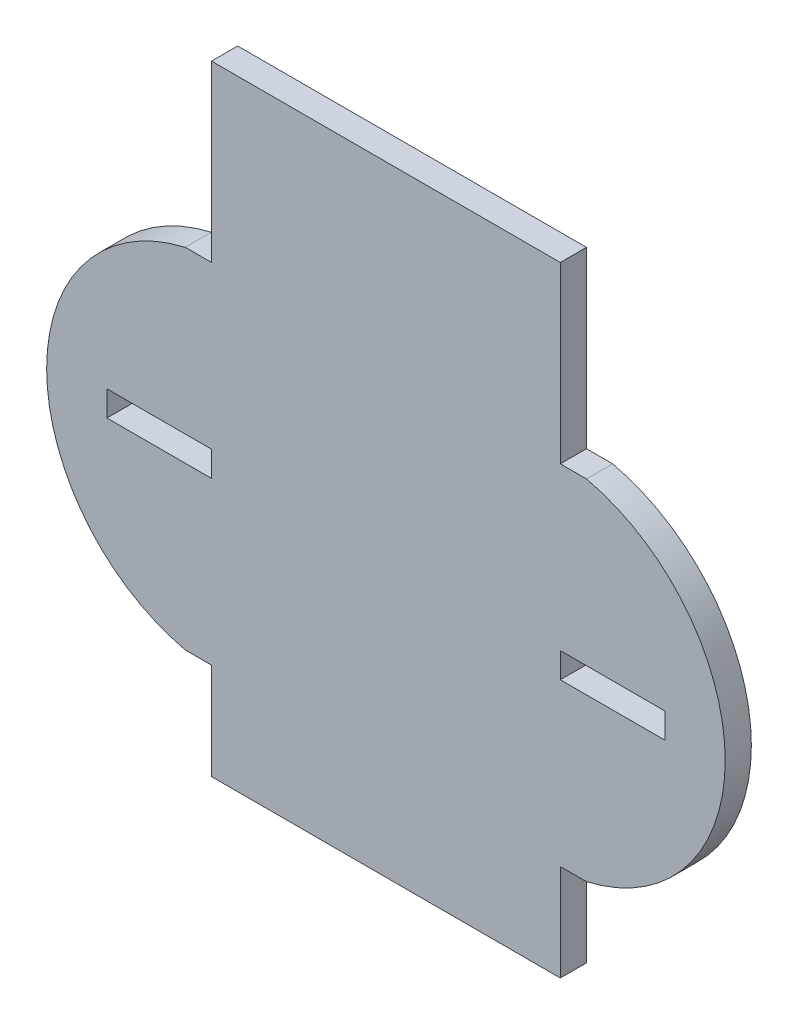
ISO-10303-21;
HEADER;
FILE_DESCRIPTION(('STEP AP214'),'2;1');
FILE_NAME('part.step','',(''),(''),'','','');
FILE_SCHEMA(('AUTOMOTIVE_DESIGN { 1 0 10303 214 1 1 1 1 }'));
ENDSEC;
DATA;
#1=APPLICATION_CONTEXT('core data for automotive mechanical design processes');
#2=APPLICATION_PROTOCOL_DEFINITION('international standard','automotive_design',2000,#1);
#3=PRODUCT_CONTEXT('',#1,'mechanical');
#4=PRODUCT('Part','Part','',(#3));
#5=PRODUCT_RELATED_PRODUCT_CATEGORY('part','',(#4));
#6=PRODUCT_DEFINITION_FORMATION('','',#4);
#7=PRODUCT_DEFINITION_CONTEXT('part definition',#1,'design');
#8=PRODUCT_DEFINITION('design','',#6,#7);
#9=PRODUCT_DEFINITION_SHAPE('','',#8);
#10=(LENGTH_UNIT() NAMED_UNIT(*) SI_UNIT(.MILLI.,.METRE.));
#11=(NAMED_UNIT(*) PLANE_ANGLE_UNIT() SI_UNIT($,.RADIAN.));
#12=(NAMED_UNIT(*) SI_UNIT($,.STERADIAN.) SOLID_ANGLE_UNIT());
#13=UNCERTAINTY_MEASURE_WITH_UNIT(LENGTH_MEASURE(1.E-05),#10,'distance_accuracy_value','');
#14=(GEOMETRIC_REPRESENTATION_CONTEXT(3) GLOBAL_UNCERTAINTY_ASSIGNED_CONTEXT((#13)) GLOBAL_UNIT_ASSIGNED_CONTEXT((#10,
#11,#12)) REPRESENTATION_CONTEXT('',''));
#15=CARTESIAN_POINT('',(0.,0.,0.));
#16=DIRECTION('',(0.,0.,1.));
#17=DIRECTION('',(1.,0.,0.));
#18=AXIS2_PLACEMENT_3D('',#15,#16,#17);
#19=CARTESIAN_POINT('',(-18.3874483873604,0.,3.));
#20=DIRECTION('',(0.,0.,-1.));
#21=DIRECTION('',(-1.,0.,0.));
#22=AXIS2_PLACEMENT_3D('',#19,#20,#21);
#23=PLANE('',#22);
#24=DIRECTION('',(0.,1.,0.));
#25=VECTOR('',#24,1.);
#26=CARTESIAN_POINT('',(-20.,1.45,3.));
#27=LINE('',#26,#25);
#28=CARTESIAN_POINT('',(-20.,-1.45,3.));
#29=VERTEX_POINT('',#28);
#30=CARTESIAN_POINT('',(-20.,1.45,3.));
#31=VERTEX_POINT('',#30);
#32=EDGE_CURVE('E206',#29,#31,#27,.T.);
#33=ORIENTED_EDGE('',*,*,#32,.F.);
#34=DIRECTION('',(1.,0.,0.));
#35=VECTOR('',#34,1.);
#36=CARTESIAN_POINT('',(-32.,-1.45,3.));
#37=LINE('',#36,#35);
#38=CARTESIAN_POINT('',(-32.,-1.45,3.));
#39=VERTEX_POINT('',#38);
#40=EDGE_CURVE('E214',#39,#29,#37,.T.);
#41=ORIENTED_EDGE('',*,*,#40,.F.);
#42=DIRECTION('',(0.,-1.,0.));
#43=VECTOR('',#42,1.);
#44=CARTESIAN_POINT('',(-32.,1.45,3.));
#45=LINE('',#44,#43);
#46=CARTESIAN_POINT('',(-32.,1.45,3.));
#47=VERTEX_POINT('',#46);
#48=EDGE_CURVE('E211',#47,#39,#45,.T.);
#49=ORIENTED_EDGE('',*,*,#48,.F.);
#50=DIRECTION('',(-1.,0.,0.));
#51=VECTOR('',#50,1.);
#52=CARTESIAN_POINT('',(-32.,1.45,3.));
#53=LINE('',#52,#51);
#54=EDGE_CURVE('E208',#31,#47,#53,.T.);
#55=ORIENTED_EDGE('',*,*,#54,.F.);
#56=EDGE_LOOP('',(#33,#41,#49,#55));
#57=FACE_BOUND('',#56,.T.);
#58=DIRECTION('',(0.,1.,0.));
#59=VECTOR('',#58,1.);
#60=CARTESIAN_POINT('',(20.,20.,3.));
#61=LINE('',#60,#59);
#62=CARTESIAN_POINT('',(20.,20.,3.));
#63=VERTEX_POINT('',#62);
#64=CARTESIAN_POINT('',(20.,40.,3.));
#65=VERTEX_POINT('',#64);
#66=EDGE_CURVE('E237',#63,#65,#61,.T.);
#67=ORIENTED_EDGE('',*,*,#66,.T.);
#68=DIRECTION('',(-1.,0.,0.));
#69=VECTOR('',#68,1.);
#70=CARTESIAN_POINT('',(-20.,40.,3.));
#71=LINE('',#70,#69);
#72=CARTESIAN_POINT('',(-20.,40.,3.));
#73=VERTEX_POINT('',#72);
#74=EDGE_CURVE('E240',#65,#73,#71,.T.);
#75=ORIENTED_EDGE('',*,*,#74,.T.);
#76=DIRECTION('',(0.,-1.,0.));
#77=VECTOR('',#76,1.);
#78=CARTESIAN_POINT('',(-20.,20.,3.));
#79=LINE('',#78,#77);
#80=CARTESIAN_POINT('',(-20.,20.,3.));
#81=VERTEX_POINT('',#80);
#82=EDGE_CURVE('E243',#73,#81,#79,.T.);
#83=ORIENTED_EDGE('',*,*,#82,.T.);
#84=DIRECTION('',(-1.,0.,0.));
#85=VECTOR('',#84,1.);
#86=CARTESIAN_POINT('',(-23.,20.,3.));
#87=LINE('',#86,#85);
#88=CARTESIAN_POINT('',(-23.,20.,3.));
#89=VERTEX_POINT('',#88);
#90=EDGE_CURVE('E245',#81,#89,#87,.T.);
#91=ORIENTED_EDGE('',*,*,#90,.T.);
#92=CARTESIAN_POINT('',(-18.3874483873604,0.,3.));
#93=DIRECTION('',(0.,0.,1.));
#94=DIRECTION('',(-1.,0.,0.));
#95=AXIS2_PLACEMENT_3D('',#92,#93,#94);
#96=CIRCLE('',#95,20.5250001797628);
#97=CARTESIAN_POINT('',(-23.,-20.,3.));
#98=VERTEX_POINT('',#97);
#99=EDGE_CURVE('E247',#89,#98,#96,.T.);
#100=ORIENTED_EDGE('',*,*,#99,.T.);
#101=DIRECTION('',(1.,0.,0.));
#102=VECTOR('',#101,1.);
#103=CARTESIAN_POINT('',(-23.,-20.,3.));
#104=LINE('',#103,#102);
#105=CARTESIAN_POINT('',(-20.,-20.,3.));
#106=VERTEX_POINT('',#105);
#107=EDGE_CURVE('E249',#98,#106,#104,.T.);
#108=ORIENTED_EDGE('',*,*,#107,.T.);
#109=DIRECTION('',(0.,-1.,0.));
#110=VECTOR('',#109,1.);
#111=CARTESIAN_POINT('',(-20.,-31.071211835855,3.));
#112=LINE('',#111,#110);
#113=CARTESIAN_POINT('',(-20.,-31.071211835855,3.));
#114=VERTEX_POINT('',#113);
#115=EDGE_CURVE('E251',#106,#114,#112,.T.);
#116=ORIENTED_EDGE('',*,*,#115,.T.);
#117=DIRECTION('',(1.,0.,0.));
#118=VECTOR('',#117,1.);
#119=CARTESIAN_POINT('',(-20.,-31.071211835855,3.));
#120=LINE('',#119,#118);
#121=CARTESIAN_POINT('',(20.,-31.071211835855,3.));
#122=VERTEX_POINT('',#121);
#123=EDGE_CURVE('E253',#114,#122,#120,.T.);
#124=ORIENTED_EDGE('',*,*,#123,.T.);
#125=DIRECTION('',(0.,1.,0.));
#126=VECTOR('',#125,1.);
#127=CARTESIAN_POINT('',(20.,-31.071211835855,3.));
#128=LINE('',#127,#126);
#129=CARTESIAN_POINT('',(20.,-20.,3.));
#130=VERTEX_POINT('',#129);
#131=EDGE_CURVE('E255',#122,#130,#128,.T.);
#132=ORIENTED_EDGE('',*,*,#131,.T.);
#133=DIRECTION('',(1.,0.,0.));
#134=VECTOR('',#133,1.);
#135=CARTESIAN_POINT('',(23.,-20.,3.));
#136=LINE('',#135,#134);
#137=CARTESIAN_POINT('',(23.,-20.,3.));
#138=VERTEX_POINT('',#137);
#139=EDGE_CURVE('E257',#130,#138,#136,.T.);
#140=ORIENTED_EDGE('',*,*,#139,.T.);
#141=CARTESIAN_POINT('',(18.3874483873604,0.,3.));
#142=DIRECTION('',(0.,0.,1.));
#143=DIRECTION('',(1.,0.,0.));
#144=AXIS2_PLACEMENT_3D('',#141,#142,#143);
#145=CIRCLE('',#144,20.5250001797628);
#146=CARTESIAN_POINT('',(23.,20.,3.));
#147=VERTEX_POINT('',#146);
#148=EDGE_CURVE('E259',#138,#147,#145,.T.);
#149=ORIENTED_EDGE('',*,*,#148,.T.);
#150=DIRECTION('',(-1.,0.,0.));
#151=VECTOR('',#150,1.);
#152=CARTESIAN_POINT('',(23.,20.,3.));
#153=LINE('',#152,#151);
#154=EDGE_CURVE('E261',#147,#63,#153,.T.);
#155=ORIENTED_EDGE('',*,*,#154,.T.);
#156=EDGE_LOOP('',(#67,#75,#83,#91,#100,#108,#116,#124,#132,#140,#149,#155));
#157=FACE_BOUND('',#156,.T.);
#158=DIRECTION('',(-1.,0.,0.));
#159=VECTOR('',#158,1.);
#160=CARTESIAN_POINT('',(32.,1.45000000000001,3.));
#161=LINE('',#160,#159);
#162=CARTESIAN_POINT('',(32.,1.45000000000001,3.));
#163=VERTEX_POINT('',#162);
#164=CARTESIAN_POINT('',(20.,1.45,3.));
#165=VERTEX_POINT('',#164);
#166=EDGE_CURVE('E170',#163,#165,#161,.T.);
#167=ORIENTED_EDGE('',*,*,#166,.F.);
#168=DIRECTION('',(0.,1.,0.));
#169=VECTOR('',#168,1.);
#170=CARTESIAN_POINT('',(32.,1.45000000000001,3.));
#171=LINE('',#170,#169);
#172=CARTESIAN_POINT('',(32.,-1.44999999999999,3.));
#173=VERTEX_POINT('',#172);
#174=EDGE_CURVE('E192',#173,#163,#171,.T.);
#175=ORIENTED_EDGE('',*,*,#174,.F.);
#176=DIRECTION('',(1.,0.,0.));
#177=VECTOR('',#176,1.);
#178=CARTESIAN_POINT('',(32.,-1.44999999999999,3.));
#179=LINE('',#178,#177);
#180=CARTESIAN_POINT('',(20.,-1.44999999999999,3.));
#181=VERTEX_POINT('',#180);
#182=EDGE_CURVE('E190',#181,#173,#179,.T.);
#183=ORIENTED_EDGE('',*,*,#182,.F.);
#184=DIRECTION('',(0.,-1.,0.));
#185=VECTOR('',#184,1.);
#186=CARTESIAN_POINT('',(20.,1.45,3.));
#187=LINE('',#186,#185);
#188=EDGE_CURVE('E178',#165,#181,#187,.T.);
#189=ORIENTED_EDGE('',*,*,#188,.F.);
#190=EDGE_LOOP('',(#167,#175,#183,#189));
#191=FACE_BOUND('',#190,.T.);
#192=ADVANCED_FACE('F33',(#57,#157,#191),#23,.F.);
#193=CARTESIAN_POINT('',(-18.3874483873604,0.,0.));
#194=DIRECTION('',(0.,0.,-1.));
#195=DIRECTION('',(-1.,0.,0.));
#196=AXIS2_PLACEMENT_3D('',#193,#194,#195);
#197=PLANE('',#196);
#198=DIRECTION('',(0.,1.,0.));
#199=VECTOR('',#198,1.);
#200=CARTESIAN_POINT('',(20.,20.,0.));
#201=LINE('',#200,#199);
#202=CARTESIAN_POINT('',(20.,20.,0.));
#203=VERTEX_POINT('',#202);
#204=CARTESIAN_POINT('',(20.,40.,0.));
#205=VERTEX_POINT('',#204);
#206=EDGE_CURVE('E236',#203,#205,#201,.T.);
#207=ORIENTED_EDGE('',*,*,#206,.F.);
#208=DIRECTION('',(-1.,0.,0.));
#209=VECTOR('',#208,1.);
#210=CARTESIAN_POINT('',(23.,20.,0.));
#211=LINE('',#210,#209);
#212=CARTESIAN_POINT('',(23.,20.,0.));
#213=VERTEX_POINT('',#212);
#214=EDGE_CURVE('E241',#213,#203,#211,.T.);
#215=ORIENTED_EDGE('',*,*,#214,.F.);
#216=CARTESIAN_POINT('',(18.3874483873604,0.,0.));
#217=DIRECTION('',(0.,0.,1.));
#218=DIRECTION('',(1.,0.,0.));
#219=AXIS2_PLACEMENT_3D('',#216,#217,#218);
#220=CIRCLE('',#219,20.5250001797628);
#221=CARTESIAN_POINT('',(23.,-20.,0.));
#222=VERTEX_POINT('',#221);
#223=EDGE_CURVE('E284',#222,#213,#220,.T.);
#224=ORIENTED_EDGE('',*,*,#223,.F.);
#225=DIRECTION('',(1.,0.,0.));
#226=VECTOR('',#225,1.);
#227=CARTESIAN_POINT('',(23.,-20.,0.));
#228=LINE('',#227,#226);
#229=CARTESIAN_POINT('',(20.,-20.,0.));
#230=VERTEX_POINT('',#229);
#231=EDGE_CURVE('E282',#230,#222,#228,.T.);
#232=ORIENTED_EDGE('',*,*,#231,.F.);
#233=DIRECTION('',(0.,1.,0.));
#234=VECTOR('',#233,1.);
#235=CARTESIAN_POINT('',(20.,-31.071211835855,0.));
#236=LINE('',#235,#234);
#237=CARTESIAN_POINT('',(20.,-31.071211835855,0.));
#238=VERTEX_POINT('',#237);
#239=EDGE_CURVE('E280',#238,#230,#236,.T.);
#240=ORIENTED_EDGE('',*,*,#239,.F.);
#241=DIRECTION('',(1.,0.,0.));
#242=VECTOR('',#241,1.);
#243=CARTESIAN_POINT('',(-20.,-31.071211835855,0.));
#244=LINE('',#243,#242);
#245=CARTESIAN_POINT('',(-20.,-31.071211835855,0.));
#246=VERTEX_POINT('',#245);
#247=EDGE_CURVE('E278',#246,#238,#244,.T.);
#248=ORIENTED_EDGE('',*,*,#247,.F.);
#249=DIRECTION('',(0.,-1.,0.));
#250=VECTOR('',#249,1.);
#251=CARTESIAN_POINT('',(-20.,-31.071211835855,0.));
#252=LINE('',#251,#250);
#253=CARTESIAN_POINT('',(-20.,-20.,0.));
#254=VERTEX_POINT('',#253);
#255=EDGE_CURVE('E276',#254,#246,#252,.T.);
#256=ORIENTED_EDGE('',*,*,#255,.F.);
#257=DIRECTION('',(1.,0.,0.));
#258=VECTOR('',#257,1.);
#259=CARTESIAN_POINT('',(-23.,-20.,0.));
#260=LINE('',#259,#258);
#261=CARTESIAN_POINT('',(-23.,-20.,0.));
#262=VERTEX_POINT('',#261);
#263=EDGE_CURVE('E274',#262,#254,#260,.T.);
#264=ORIENTED_EDGE('',*,*,#263,.F.);
#265=CARTESIAN_POINT('',(-18.3874483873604,0.,0.));
#266=DIRECTION('',(0.,0.,1.));
#267=DIRECTION('',(-1.,0.,0.));
#268=AXIS2_PLACEMENT_3D('',#265,#266,#267);
#269=CIRCLE('',#268,20.5250001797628);
#270=CARTESIAN_POINT('',(-23.,20.,0.));
#271=VERTEX_POINT('',#270);
#272=EDGE_CURVE('E272',#271,#262,#269,.T.);
#273=ORIENTED_EDGE('',*,*,#272,.F.);
#274=DIRECTION('',(-1.,0.,0.));
#275=VECTOR('',#274,1.);
#276=CARTESIAN_POINT('',(-23.,20.,0.));
#277=LINE('',#276,#275);
#278=CARTESIAN_POINT('',(-20.,20.,0.));
#279=VERTEX_POINT('',#278);
#280=EDGE_CURVE('E270',#279,#271,#277,.T.);
#281=ORIENTED_EDGE('',*,*,#280,.F.);
#282=DIRECTION('',(0.,-1.,0.));
#283=VECTOR('',#282,1.);
#284=CARTESIAN_POINT('',(-20.,20.,0.));
#285=LINE('',#284,#283);
#286=CARTESIAN_POINT('',(-20.,40.,0.));
#287=VERTEX_POINT('',#286);
#288=EDGE_CURVE('E268',#287,#279,#285,.T.);
#289=ORIENTED_EDGE('',*,*,#288,.F.);
#290=DIRECTION('',(-1.,0.,0.));
#291=VECTOR('',#290,1.);
#292=CARTESIAN_POINT('',(-20.,40.,0.));
#293=LINE('',#292,#291);
#294=EDGE_CURVE('E266',#205,#287,#293,.T.);
#295=ORIENTED_EDGE('',*,*,#294,.F.);
#296=EDGE_LOOP('',(#207,#215,#224,#232,#240,#248,#256,#264,#273,#281,#289,#295));
#297=FACE_BOUND('',#296,.T.);
#298=DIRECTION('',(1.,0.,0.));
#299=VECTOR('',#298,1.);
#300=CARTESIAN_POINT('',(-32.,-1.45,0.));
#301=LINE('',#300,#299);
#302=CARTESIAN_POINT('',(-32.,-1.45,0.));
#303=VERTEX_POINT('',#302);
#304=CARTESIAN_POINT('',(-20.,-1.45,0.));
#305=VERTEX_POINT('',#304);
#306=EDGE_CURVE('E209',#303,#305,#301,.T.);
#307=ORIENTED_EDGE('',*,*,#306,.T.);
#308=DIRECTION('',(0.,1.,0.));
#309=VECTOR('',#308,1.);
#310=CARTESIAN_POINT('',(-20.,1.45,0.));
#311=LINE('',#310,#309);
#312=CARTESIAN_POINT('',(-20.,1.45,0.));
#313=VERTEX_POINT('',#312);
#314=EDGE_CURVE('E186',#305,#313,#311,.T.);
#315=ORIENTED_EDGE('',*,*,#314,.T.);
#316=DIRECTION('',(-1.,0.,0.));
#317=VECTOR('',#316,1.);
#318=CARTESIAN_POINT('',(-32.,1.45,0.));
#319=LINE('',#318,#317);
#320=CARTESIAN_POINT('',(-32.,1.45,0.));
#321=VERTEX_POINT('',#320);
#322=EDGE_CURVE('E219',#313,#321,#319,.T.);
#323=ORIENTED_EDGE('',*,*,#322,.T.);
#324=DIRECTION('',(0.,-1.,0.));
#325=VECTOR('',#324,1.);
#326=CARTESIAN_POINT('',(-32.,1.45,0.));
#327=LINE('',#326,#325);
#328=EDGE_CURVE('E222',#321,#303,#327,.T.);
#329=ORIENTED_EDGE('',*,*,#328,.T.);
#330=EDGE_LOOP('',(#307,#315,#323,#329));
#331=FACE_BOUND('',#330,.T.);
#332=DIRECTION('',(0.,1.,0.));
#333=VECTOR('',#332,1.);
#334=CARTESIAN_POINT('',(32.,1.45000000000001,0.));
#335=LINE('',#334,#333);
#336=CARTESIAN_POINT('',(32.,-1.44999999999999,0.));
#337=VERTEX_POINT('',#336);
#338=CARTESIAN_POINT('',(32.,1.45000000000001,0.));
#339=VERTEX_POINT('',#338);
#340=EDGE_CURVE('E179',#337,#339,#335,.T.);
#341=ORIENTED_EDGE('',*,*,#340,.T.);
#342=DIRECTION('',(-1.,0.,0.));
#343=VECTOR('',#342,1.);
#344=CARTESIAN_POINT('',(32.,1.45000000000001,0.));
#345=LINE('',#344,#343);
#346=CARTESIAN_POINT('',(20.,1.45,0.));
#347=VERTEX_POINT('',#346);
#348=EDGE_CURVE('E56',#339,#347,#345,.T.);
#349=ORIENTED_EDGE('',*,*,#348,.T.);
#350=DIRECTION('',(0.,-1.,0.));
#351=VECTOR('',#350,1.);
#352=CARTESIAN_POINT('',(20.,1.45,0.));
#353=LINE('',#352,#351);
#354=CARTESIAN_POINT('',(20.,-1.44999999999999,0.));
#355=VERTEX_POINT('',#354);
#356=EDGE_CURVE('E185',#347,#355,#353,.T.);
#357=ORIENTED_EDGE('',*,*,#356,.T.);
#358=DIRECTION('',(1.,0.,0.));
#359=VECTOR('',#358,1.);
#360=CARTESIAN_POINT('',(32.,-1.44999999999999,0.));
#361=LINE('',#360,#359);
#362=EDGE_CURVE('E198',#355,#337,#361,.T.);
#363=ORIENTED_EDGE('',*,*,#362,.T.);
#364=EDGE_LOOP('',(#341,#349,#357,#363));
#365=FACE_BOUND('',#364,.T.);
#366=ADVANCED_FACE('F326',(#297,#331,#365),#197,.T.);
#367=CARTESIAN_POINT('',(20.,20.,3.));
#368=DIRECTION('',(-1.,0.,0.));
#369=DIRECTION('',(0.,-1.,0.));
#370=AXIS2_PLACEMENT_3D('',#367,#368,#369);
#371=PLANE('',#370);
#372=ORIENTED_EDGE('',*,*,#206,.T.);
#373=DIRECTION('',(0.,0.,-1.));
#374=VECTOR('',#373,1.);
#375=CARTESIAN_POINT('',(20.,40.,3.));
#376=LINE('',#375,#374);
#377=EDGE_CURVE('E11',#65,#205,#376,.T.);
#378=ORIENTED_EDGE('',*,*,#377,.F.);
#379=ORIENTED_EDGE('',*,*,#66,.F.);
#380=DIRECTION('',(0.,0.,-1.));
#381=VECTOR('',#380,1.);
#382=CARTESIAN_POINT('',(20.,20.,3.));
#383=LINE('',#382,#381);
#384=EDGE_CURVE('E263',#63,#203,#383,.T.);
#385=ORIENTED_EDGE('',*,*,#384,.T.);
#386=EDGE_LOOP('',(#372,#378,#379,#385));
#387=FACE_BOUND('',#386,.T.);
#388=ADVANCED_FACE('F35',(#387),#371,.F.);
#389=CARTESIAN_POINT('',(-20.,40.,3.));
#390=DIRECTION('',(0.,-1.,0.));
#391=DIRECTION('',(0.,0.,-1.));
#392=AXIS2_PLACEMENT_3D('',#389,#390,#391);
#393=PLANE('',#392);
#394=ORIENTED_EDGE('',*,*,#294,.T.);
#395=DIRECTION('',(0.,0.,-1.));
#396=VECTOR('',#395,1.);
#397=CARTESIAN_POINT('',(-20.,40.,3.));
#398=LINE('',#397,#396);
#399=EDGE_CURVE('E41',#73,#287,#398,.T.);
#400=ORIENTED_EDGE('',*,*,#399,.F.);
#401=ORIENTED_EDGE('',*,*,#74,.F.);
#402=ORIENTED_EDGE('',*,*,#377,.T.);
#403=EDGE_LOOP('',(#394,#400,#401,#402));
#404=FACE_BOUND('',#403,.T.);
#405=ADVANCED_FACE('F343',(#404),#393,.F.);
#406=CARTESIAN_POINT('',(-20.,20.,3.));
#407=DIRECTION('',(1.,0.,0.));
#408=DIRECTION('',(0.,0.,-1.));
#409=AXIS2_PLACEMENT_3D('',#406,#407,#408);
#410=PLANE('',#409);
#411=ORIENTED_EDGE('',*,*,#288,.T.);
#412=DIRECTION('',(0.,0.,-1.));
#413=VECTOR('',#412,1.);
#414=CARTESIAN_POINT('',(-20.,20.,3.));
#415=LINE('',#414,#413);
#416=EDGE_CURVE('E313',#81,#279,#415,.T.);
#417=ORIENTED_EDGE('',*,*,#416,.F.);
#418=ORIENTED_EDGE('',*,*,#82,.F.);
#419=ORIENTED_EDGE('',*,*,#399,.T.);
#420=EDGE_LOOP('',(#411,#417,#418,#419));
#421=FACE_BOUND('',#420,.T.);
#422=ADVANCED_FACE('F320',(#421),#410,.F.);
#423=CARTESIAN_POINT('',(-23.,20.,3.));
#424=DIRECTION('',(0.,-1.,0.));
#425=DIRECTION('',(0.,0.,-1.));
#426=AXIS2_PLACEMENT_3D('',#423,#424,#425);
#427=PLANE('',#426);
#428=ORIENTED_EDGE('',*,*,#280,.T.);
#429=DIRECTION('',(0.,0.,-1.));
#430=VECTOR('',#429,1.);
#431=CARTESIAN_POINT('',(-23.,20.,3.));
#432=LINE('',#431,#430);
#433=EDGE_CURVE('E310',#89,#271,#432,.T.);
#434=ORIENTED_EDGE('',*,*,#433,.F.);
#435=ORIENTED_EDGE('',*,*,#90,.F.);
#436=ORIENTED_EDGE('',*,*,#416,.T.);
#437=EDGE_LOOP('',(#428,#434,#435,#436));
#438=FACE_BOUND('',#437,.T.);
#439=ADVANCED_FACE('F332',(#438),#427,.F.);
#440=CARTESIAN_POINT('',(-18.3874483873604,0.,3.));
#441=DIRECTION('',(0.,0.,-1.));
#442=DIRECTION('',(-1.,0.,0.));
#443=AXIS2_PLACEMENT_3D('',#440,#441,#442);
#444=CYLINDRICAL_SURFACE('',#443,20.5250001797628);
#445=ORIENTED_EDGE('',*,*,#272,.T.);
#446=DIRECTION('',(0.,0.,-1.));
#447=VECTOR('',#446,1.);
#448=CARTESIAN_POINT('',(-23.,-20.,3.));
#449=LINE('',#448,#447);
#450=EDGE_CURVE('E307',#98,#262,#449,.T.);
#451=ORIENTED_EDGE('',*,*,#450,.F.);
#452=ORIENTED_EDGE('',*,*,#99,.F.);
#453=ORIENTED_EDGE('',*,*,#433,.T.);
#454=EDGE_LOOP('',(#445,#451,#452,#453));
#455=FACE_BOUND('',#454,.T.);
#456=ADVANCED_FACE('F336',(#455),#444,.T.);
#457=CARTESIAN_POINT('',(-23.,-20.,3.));
#458=DIRECTION('',(0.,1.,0.));
#459=DIRECTION('',(0.,0.,1.));
#460=AXIS2_PLACEMENT_3D('',#457,#458,#459);
#461=PLANE('',#460);
#462=ORIENTED_EDGE('',*,*,#263,.T.);
#463=DIRECTION('',(0.,0.,-1.));
#464=VECTOR('',#463,1.);
#465=CARTESIAN_POINT('',(-20.,-20.,3.));
#466=LINE('',#465,#464);
#467=EDGE_CURVE('E304',#106,#254,#466,.T.);
#468=ORIENTED_EDGE('',*,*,#467,.F.);
#469=ORIENTED_EDGE('',*,*,#107,.F.);
#470=ORIENTED_EDGE('',*,*,#450,.T.);
#471=EDGE_LOOP('',(#462,#468,#469,#470));
#472=FACE_BOUND('',#471,.T.);
#473=ADVANCED_FACE('F376',(#472),#461,.F.);
#474=CARTESIAN_POINT('',(-20.,-31.071211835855,3.));
#475=DIRECTION('',(1.,0.,0.));
#476=DIRECTION('',(0.,0.,-1.));
#477=AXIS2_PLACEMENT_3D('',#474,#475,#476);
#478=PLANE('',#477);
#479=ORIENTED_EDGE('',*,*,#255,.T.);
#480=DIRECTION('',(0.,0.,-1.));
#481=VECTOR('',#480,1.);
#482=CARTESIAN_POINT('',(-20.,-31.071211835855,3.));
#483=LINE('',#482,#481);
#484=EDGE_CURVE('E301',#114,#246,#483,.T.);
#485=ORIENTED_EDGE('',*,*,#484,.F.);
#486=ORIENTED_EDGE('',*,*,#115,.F.);
#487=ORIENTED_EDGE('',*,*,#467,.T.);
#488=EDGE_LOOP('',(#479,#485,#486,#487));
#489=FACE_BOUND('',#488,.T.);
#490=ADVANCED_FACE('F374',(#489),#478,.F.);
#491=CARTESIAN_POINT('',(-20.,-31.071211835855,3.));
#492=DIRECTION('',(0.,1.,0.));
#493=DIRECTION('',(0.,0.,1.));
#494=AXIS2_PLACEMENT_3D('',#491,#492,#493);
#495=PLANE('',#494);
#496=ORIENTED_EDGE('',*,*,#247,.T.);
#497=DIRECTION('',(0.,0.,-1.));
#498=VECTOR('',#497,1.);
#499=CARTESIAN_POINT('',(20.,-31.071211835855,3.));
#500=LINE('',#499,#498);
#501=EDGE_CURVE('E298',#122,#238,#500,.T.);
#502=ORIENTED_EDGE('',*,*,#501,.F.);
#503=ORIENTED_EDGE('',*,*,#123,.F.);
#504=ORIENTED_EDGE('',*,*,#484,.T.);
#505=EDGE_LOOP('',(#496,#502,#503,#504));
#506=FACE_BOUND('',#505,.T.);
#507=ADVANCED_FACE('F370',(#506),#495,.F.);
#508=CARTESIAN_POINT('',(20.,-31.071211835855,3.));
#509=DIRECTION('',(-1.,0.,0.));
#510=DIRECTION('',(0.,-1.,0.));
#511=AXIS2_PLACEMENT_3D('',#508,#509,#510);
#512=PLANE('',#511);
#513=ORIENTED_EDGE('',*,*,#239,.T.);
#514=DIRECTION('',(0.,0.,-1.));
#515=VECTOR('',#514,1.);
#516=CARTESIAN_POINT('',(20.,-20.,3.));
#517=LINE('',#516,#515);
#518=EDGE_CURVE('E295',#130,#230,#517,.T.);
#519=ORIENTED_EDGE('',*,*,#518,.F.);
#520=ORIENTED_EDGE('',*,*,#131,.F.);
#521=ORIENTED_EDGE('',*,*,#501,.T.);
#522=EDGE_LOOP('',(#513,#519,#520,#521));
#523=FACE_BOUND('',#522,.T.);
#524=ADVANCED_FACE('F365',(#523),#512,.F.);
#525=CARTESIAN_POINT('',(23.,-20.,3.));
#526=DIRECTION('',(0.,1.,0.));
#527=DIRECTION('',(0.,0.,1.));
#528=AXIS2_PLACEMENT_3D('',#525,#526,#527);
#529=PLANE('',#528);
#530=ORIENTED_EDGE('',*,*,#231,.T.);
#531=DIRECTION('',(0.,0.,-1.));
#532=VECTOR('',#531,1.);
#533=CARTESIAN_POINT('',(23.,-20.,3.));
#534=LINE('',#533,#532);
#535=EDGE_CURVE('E292',#138,#222,#534,.T.);
#536=ORIENTED_EDGE('',*,*,#535,.F.);
#537=ORIENTED_EDGE('',*,*,#139,.F.);
#538=ORIENTED_EDGE('',*,*,#518,.T.);
#539=EDGE_LOOP('',(#530,#536,#537,#538));
#540=FACE_BOUND('',#539,.T.);
#541=ADVANCED_FACE('F359',(#540),#529,.F.);
#542=CARTESIAN_POINT('',(18.3874483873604,0.,3.));
#543=DIRECTION('',(0.,0.,-1.));
#544=DIRECTION('',(-1.,0.,0.));
#545=AXIS2_PLACEMENT_3D('',#542,#543,#544);
#546=CYLINDRICAL_SURFACE('',#545,20.5250001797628);
#547=ORIENTED_EDGE('',*,*,#223,.T.);
#548=DIRECTION('',(0.,0.,-1.));
#549=VECTOR('',#548,1.);
#550=CARTESIAN_POINT('',(23.,20.,3.));
#551=LINE('',#550,#549);
#552=EDGE_CURVE('E289',#147,#213,#551,.T.);
#553=ORIENTED_EDGE('',*,*,#552,.F.);
#554=ORIENTED_EDGE('',*,*,#148,.F.);
#555=ORIENTED_EDGE('',*,*,#535,.T.);
#556=EDGE_LOOP('',(#547,#553,#554,#555));
#557=FACE_BOUND('',#556,.T.);
#558=ADVANCED_FACE('F355',(#557),#546,.T.);
#559=CARTESIAN_POINT('',(23.,20.,3.));
#560=DIRECTION('',(0.,-1.,0.));
#561=DIRECTION('',(0.,0.,-1.));
#562=AXIS2_PLACEMENT_3D('',#559,#560,#561);
#563=PLANE('',#562);
#564=ORIENTED_EDGE('',*,*,#214,.T.);
#565=ORIENTED_EDGE('',*,*,#384,.F.);
#566=ORIENTED_EDGE('',*,*,#154,.F.);
#567=ORIENTED_EDGE('',*,*,#552,.T.);
#568=EDGE_LOOP('',(#564,#565,#566,#567));
#569=FACE_BOUND('',#568,.T.);
#570=ADVANCED_FACE('F350',(#569),#563,.F.);
#571=CARTESIAN_POINT('',(-20.,1.45,3.));
#572=DIRECTION('',(-1.,0.,0.));
#573=DIRECTION('',(0.,0.,1.));
#574=AXIS2_PLACEMENT_3D('',#571,#572,#573);
#575=PLANE('',#574);
#576=ORIENTED_EDGE('',*,*,#314,.F.);
#577=DIRECTION('',(0.,0.,-1.));
#578=VECTOR('',#577,1.);
#579=CARTESIAN_POINT('',(-20.,-1.45,3.));
#580=LINE('',#579,#578);
#581=EDGE_CURVE('E216',#29,#305,#580,.T.);
#582=ORIENTED_EDGE('',*,*,#581,.F.);
#583=ORIENTED_EDGE('',*,*,#32,.T.);
#584=DIRECTION('',(0.,0.,-1.));
#585=VECTOR('',#584,1.);
#586=CARTESIAN_POINT('',(-20.,1.45,3.));
#587=LINE('',#586,#585);
#588=EDGE_CURVE('E233',#31,#313,#587,.T.);
#589=ORIENTED_EDGE('',*,*,#588,.T.);
#590=EDGE_LOOP('',(#576,#582,#583,#589));
#591=FACE_BOUND('',#590,.T.);
#592=ADVANCED_FACE('F394',(#591),#575,.T.);
#593=CARTESIAN_POINT('',(-32.,1.45,3.));
#594=DIRECTION('',(0.,-1.,0.));
#595=DIRECTION('',(0.,0.,-1.));
#596=AXIS2_PLACEMENT_3D('',#593,#594,#595);
#597=PLANE('',#596);
#598=ORIENTED_EDGE('',*,*,#322,.F.);
#599=ORIENTED_EDGE('',*,*,#588,.F.);
#600=ORIENTED_EDGE('',*,*,#54,.T.);
#601=DIRECTION('',(0.,0.,-1.));
#602=VECTOR('',#601,1.);
#603=CARTESIAN_POINT('',(-32.,1.45,3.));
#604=LINE('',#603,#602);
#605=EDGE_CURVE('E231',#47,#321,#604,.T.);
#606=ORIENTED_EDGE('',*,*,#605,.T.);
#607=EDGE_LOOP('',(#598,#599,#600,#606));
#608=FACE_BOUND('',#607,.T.);
#609=ADVANCED_FACE('F432',(#608),#597,.T.);
#610=CARTESIAN_POINT('',(-32.,1.45,3.));
#611=DIRECTION('',(1.,0.,0.));
#612=DIRECTION('',(0.,0.,-1.));
#613=AXIS2_PLACEMENT_3D('',#610,#611,#612);
#614=PLANE('',#613);
#615=ORIENTED_EDGE('',*,*,#328,.F.);
#616=ORIENTED_EDGE('',*,*,#605,.F.);
#617=ORIENTED_EDGE('',*,*,#48,.T.);
#618=DIRECTION('',(0.,0.,-1.));
#619=VECTOR('',#618,1.);
#620=CARTESIAN_POINT('',(-32.,-1.45,3.));
#621=LINE('',#620,#619);
#622=EDGE_CURVE('E229',#39,#303,#621,.T.);
#623=ORIENTED_EDGE('',*,*,#622,.T.);
#624=EDGE_LOOP('',(#615,#616,#617,#623));
#625=FACE_BOUND('',#624,.T.);
#626=ADVANCED_FACE('F439',(#625),#614,.T.);
#627=CARTESIAN_POINT('',(-32.,-1.45,3.));
#628=DIRECTION('',(0.,1.,0.));
#629=DIRECTION('',(-1.,0.,0.));
#630=AXIS2_PLACEMENT_3D('',#627,#628,#629);
#631=PLANE('',#630);
#632=ORIENTED_EDGE('',*,*,#306,.F.);
#633=ORIENTED_EDGE('',*,*,#622,.F.);
#634=ORIENTED_EDGE('',*,*,#40,.T.);
#635=ORIENTED_EDGE('',*,*,#581,.T.);
#636=EDGE_LOOP('',(#632,#633,#634,#635));
#637=FACE_BOUND('',#636,.T.);
#638=ADVANCED_FACE('F446',(#637),#631,.T.);
#639=CARTESIAN_POINT('',(32.,1.45000000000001,3.));
#640=DIRECTION('',(0.,-1.,0.));
#641=DIRECTION('',(1.,0.,0.));
#642=AXIS2_PLACEMENT_3D('',#639,#640,#641);
#643=PLANE('',#642);
#644=ORIENTED_EDGE('',*,*,#348,.F.);
#645=DIRECTION('',(0.,0.,-1.));
#646=VECTOR('',#645,1.);
#647=CARTESIAN_POINT('',(32.,1.45000000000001,3.));
#648=LINE('',#647,#646);
#649=EDGE_CURVE('E174',#163,#339,#648,.T.);
#650=ORIENTED_EDGE('',*,*,#649,.F.);
#651=ORIENTED_EDGE('',*,*,#166,.T.);
#652=DIRECTION('',(0.,0.,-1.));
#653=VECTOR('',#652,1.);
#654=CARTESIAN_POINT('',(20.,1.45,3.));
#655=LINE('',#654,#653);
#656=EDGE_CURVE('E173',#165,#347,#655,.T.);
#657=ORIENTED_EDGE('',*,*,#656,.T.);
#658=EDGE_LOOP('',(#644,#650,#651,#657));
#659=FACE_BOUND('',#658,.T.);
#660=ADVANCED_FACE('F172',(#659),#643,.T.);
#661=CARTESIAN_POINT('',(20.,1.45,3.));
#662=DIRECTION('',(1.,0.,0.));
#663=DIRECTION('',(0.,0.,-1.));
#664=AXIS2_PLACEMENT_3D('',#661,#662,#663);
#665=PLANE('',#664);
#666=ORIENTED_EDGE('',*,*,#356,.F.);
#667=ORIENTED_EDGE('',*,*,#656,.F.);
#668=ORIENTED_EDGE('',*,*,#188,.T.);
#669=DIRECTION('',(0.,0.,-1.));
#670=VECTOR('',#669,1.);
#671=CARTESIAN_POINT('',(20.,-1.44999999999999,3.));
#672=LINE('',#671,#670);
#673=EDGE_CURVE('E187',#181,#355,#672,.T.);
#674=ORIENTED_EDGE('',*,*,#673,.T.);
#675=EDGE_LOOP('',(#666,#667,#668,#674));
#676=FACE_BOUND('',#675,.T.);
#677=ADVANCED_FACE('F182',(#676),#665,.T.);
#678=CARTESIAN_POINT('',(32.,-1.44999999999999,3.));
#679=DIRECTION('',(0.,1.,0.));
#680=DIRECTION('',(-1.,0.,0.));
#681=AXIS2_PLACEMENT_3D('',#678,#679,#680);
#682=PLANE('',#681);
#683=ORIENTED_EDGE('',*,*,#362,.F.);
#684=ORIENTED_EDGE('',*,*,#673,.F.);
#685=ORIENTED_EDGE('',*,*,#182,.T.);
#686=DIRECTION('',(0.,0.,-1.));
#687=VECTOR('',#686,1.);
#688=CARTESIAN_POINT('',(32.,-1.44999999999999,3.));
#689=LINE('',#688,#687);
#690=EDGE_CURVE('E48',#173,#337,#689,.T.);
#691=ORIENTED_EDGE('',*,*,#690,.T.);
#692=EDGE_LOOP('',(#683,#684,#685,#691));
#693=FACE_BOUND('',#692,.T.);
#694=ADVANCED_FACE('F467',(#693),#682,.T.);
#695=CARTESIAN_POINT('',(32.,1.45000000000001,3.));
#696=DIRECTION('',(-1.,0.,0.));
#697=DIRECTION('',(0.,0.,1.));
#698=AXIS2_PLACEMENT_3D('',#695,#696,#697);
#699=PLANE('',#698);
#700=ORIENTED_EDGE('',*,*,#340,.F.);
#701=ORIENTED_EDGE('',*,*,#690,.F.);
#702=ORIENTED_EDGE('',*,*,#174,.T.);
#703=ORIENTED_EDGE('',*,*,#649,.T.);
#704=EDGE_LOOP('',(#700,#701,#702,#703));
#705=FACE_BOUND('',#704,.T.);
#706=ADVANCED_FACE('F474',(#705),#699,.T.);
#707=CLOSED_SHELL('',(#192,#366,#388,#405,#422,#439,#456,#473,#490,#507,#524,#541,#558,#570,
#592,#609,#626,#638,#660,#677,#694,#706));
#708=MANIFOLD_SOLID_BREP('B2',#707);
#709=ADVANCED_BREP_SHAPE_REPRESENTATION('',(#18,#708),#14);
#710=SHAPE_DEFINITION_REPRESENTATION(#9,#709);
ENDSEC;
END-ISO-10303-21;
